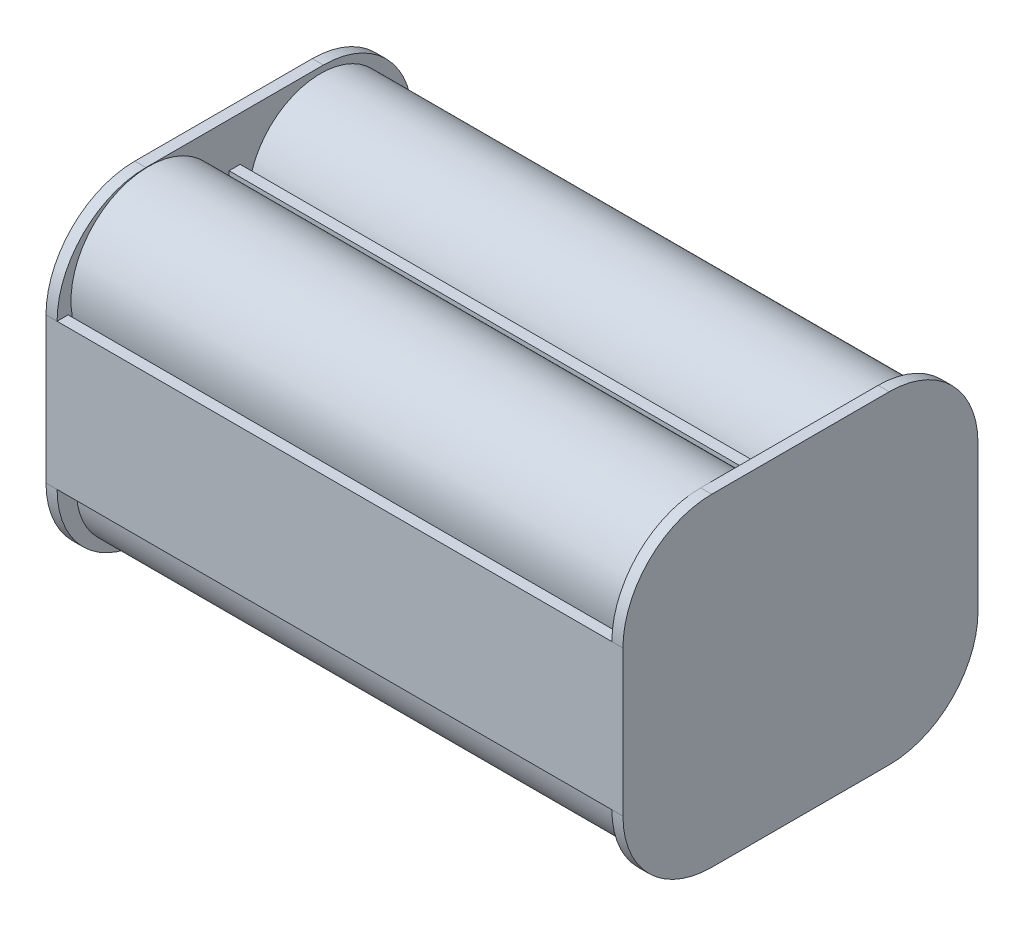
ISO-10303-21;
HEADER;
FILE_DESCRIPTION(('STEP AP214'),'2;1');
FILE_NAME('part.step','',(''),(''),'','','');
FILE_SCHEMA(('AUTOMOTIVE_DESIGN { 1 0 10303 214 1 1 1 1 }'));
ENDSEC;
DATA;
#1=APPLICATION_CONTEXT('core data for automotive mechanical design processes');
#2=APPLICATION_PROTOCOL_DEFINITION('international standard','automotive_design',2000,#1);
#3=PRODUCT_CONTEXT('',#1,'mechanical');
#4=PRODUCT('Part','Part','',(#3));
#5=PRODUCT_RELATED_PRODUCT_CATEGORY('part','',(#4));
#6=PRODUCT_DEFINITION_FORMATION('','',#4);
#7=PRODUCT_DEFINITION_CONTEXT('part definition',#1,'design');
#8=PRODUCT_DEFINITION('design','',#6,#7);
#9=PRODUCT_DEFINITION_SHAPE('','',#8);
#10=(LENGTH_UNIT() NAMED_UNIT(*) SI_UNIT(.MILLI.,.METRE.));
#11=(NAMED_UNIT(*) PLANE_ANGLE_UNIT() SI_UNIT($,.RADIAN.));
#12=(NAMED_UNIT(*) SI_UNIT($,.STERADIAN.) SOLID_ANGLE_UNIT());
#13=UNCERTAINTY_MEASURE_WITH_UNIT(LENGTH_MEASURE(1.E-05),#10,'distance_accuracy_value','');
#14=(GEOMETRIC_REPRESENTATION_CONTEXT(3) GLOBAL_UNCERTAINTY_ASSIGNED_CONTEXT((#13)) GLOBAL_UNIT_ASSIGNED_CONTEXT((#10,
#11,#12)) REPRESENTATION_CONTEXT('',''));
#15=CARTESIAN_POINT('',(0.,0.,0.));
#16=DIRECTION('',(0.,0.,1.));
#17=DIRECTION('',(1.,0.,0.));
#18=AXIS2_PLACEMENT_3D('',#15,#16,#17);
#19=CARTESIAN_POINT('',(1.,10.6966292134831,5.30337078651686));
#20=DIRECTION('',(1.,0.,0.));
#21=DIRECTION('',(0.,0.,-1.));
#22=AXIS2_PLACEMENT_3D('',#19,#20,#21);
#23=PLANE('',#22);
#24=CARTESIAN_POINT('',(1.,-3.39606741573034,5.05337078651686));
#25=DIRECTION('',(1.,0.,0.));
#26=DIRECTION('',(0.,0.,-1.));
#27=AXIS2_PLACEMENT_3D('',#24,#25,#26);
#28=CIRCLE('',#27,6.5);
#29=CARTESIAN_POINT('',(1.,-3.39606741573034,-1.44662921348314));
#30=VERTEX_POINT('',#29);
#31=EDGE_CURVE('E317',#30,#30,#28,.T.);
#32=ORIENTED_EDGE('',*,*,#31,.F.);
#33=EDGE_LOOP('',(#32));
#34=FACE_BOUND('',#33,.T.);
#35=CARTESIAN_POINT('',(1.,-2.42696629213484,-10.6966292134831));
#36=DIRECTION('',(1.,0.,0.));
#37=DIRECTION('',(0.,0.,-1.));
#38=AXIS2_PLACEMENT_3D('',#35,#36,#37);
#39=CIRCLE('',#38,8.);
#40=CARTESIAN_POINT('',(1.,-10.4269662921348,-10.6966292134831));
#41=VERTEX_POINT('',#40);
#42=CARTESIAN_POINT('',(1.,-2.42696629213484,-18.6966292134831));
#43=VERTEX_POINT('',#42);
#44=EDGE_CURVE('E490',#41,#43,#39,.T.);
#45=ORIENTED_EDGE('',*,*,#44,.T.);
#46=DIRECTION('',(0.,0.,1.));
#47=VECTOR('',#46,1.);
#48=CARTESIAN_POINT('',(1.,-2.42696629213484,0.));
#49=LINE('',#48,#47);
#50=CARTESIAN_POINT('',(1.,-2.42696629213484,-17.6966292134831));
#51=VERTEX_POINT('',#50);
#52=EDGE_CURVE('E50',#43,#51,#49,.T.);
#53=ORIENTED_EDGE('',*,*,#52,.T.);
#54=DIRECTION('',(0.,1.,0.));
#55=VECTOR('',#54,1.);
#56=CARTESIAN_POINT('',(1.,0.,-17.6966292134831));
#57=LINE('',#56,#55);
#58=CARTESIAN_POINT('',(1.,3.63483146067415,-17.6966292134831));
#59=VERTEX_POINT('',#58);
#60=EDGE_CURVE('E55',#51,#59,#57,.T.);
#61=ORIENTED_EDGE('',*,*,#60,.T.);
#62=DIRECTION('',(0.,0.,-1.));
#63=VECTOR('',#62,1.);
#64=CARTESIAN_POINT('',(1.,3.63483146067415,0.));
#65=LINE('',#64,#63);
#66=CARTESIAN_POINT('',(1.,3.63483146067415,-3.19662921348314));
#67=VERTEX_POINT('',#66);
#68=EDGE_CURVE('E420',#67,#59,#65,.T.);
#69=ORIENTED_EDGE('',*,*,#68,.F.);
#70=DIRECTION('',(0.,1.,0.));
#71=VECTOR('',#70,1.);
#72=CARTESIAN_POINT('',(1.,0.,-3.19662921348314));
#73=LINE('',#72,#71);
#74=CARTESIAN_POINT('',(1.,-6.42696629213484,-3.19662921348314));
#75=VERTEX_POINT('',#74);
#76=EDGE_CURVE('E417',#75,#67,#73,.T.);
#77=ORIENTED_EDGE('',*,*,#76,.F.);
#78=DIRECTION('',(0.,0.,-1.));
#79=VECTOR('',#78,1.);
#80=CARTESIAN_POINT('',(1.,-6.42696629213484,0.));
#81=LINE('',#80,#79);
#82=CARTESIAN_POINT('',(1.,-6.42696629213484,-2.19662921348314));
#83=VERTEX_POINT('',#82);
#84=EDGE_CURVE('E414',#83,#75,#81,.T.);
#85=ORIENTED_EDGE('',*,*,#84,.F.);
#86=DIRECTION('',(0.,-1.,0.));
#87=VECTOR('',#86,1.);
#88=CARTESIAN_POINT('',(1.,0.,-2.19662921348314));
#89=LINE('',#88,#87);
#90=CARTESIAN_POINT('',(1.,3.63483146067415,-2.19662921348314));
#91=VERTEX_POINT('',#90);
#92=EDGE_CURVE('E411',#91,#83,#89,.T.);
#93=ORIENTED_EDGE('',*,*,#92,.F.);
#94=DIRECTION('',(0.,0.,-1.));
#95=VECTOR('',#94,1.);
#96=CARTESIAN_POINT('',(1.,3.63483146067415,0.));
#97=LINE('',#96,#95);
#98=CARTESIAN_POINT('',(1.,3.63483146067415,12.3033707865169));
#99=VERTEX_POINT('',#98);
#100=EDGE_CURVE('E408',#99,#91,#97,.T.);
#101=ORIENTED_EDGE('',*,*,#100,.F.);
#102=DIRECTION('',(0.,1.,0.));
#103=VECTOR('',#102,1.);
#104=CARTESIAN_POINT('',(1.,0.,12.3033707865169));
#105=LINE('',#104,#103);
#106=CARTESIAN_POINT('',(1.,-2.42696629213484,12.3033707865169));
#107=VERTEX_POINT('',#106);
#108=EDGE_CURVE('E405',#107,#99,#105,.T.);
#109=ORIENTED_EDGE('',*,*,#108,.F.);
#110=DIRECTION('',(0.,0.,-1.));
#111=VECTOR('',#110,1.);
#112=CARTESIAN_POINT('',(1.,-2.42696629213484,0.));
#113=LINE('',#112,#111);
#114=CARTESIAN_POINT('',(1.,-2.42696629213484,13.3033707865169));
#115=VERTEX_POINT('',#114);
#116=EDGE_CURVE('E402',#115,#107,#113,.T.);
#117=ORIENTED_EDGE('',*,*,#116,.F.);
#118=CARTESIAN_POINT('',(1.,-2.42696629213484,5.30337078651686));
#119=DIRECTION('',(1.,0.,0.));
#120=DIRECTION('',(0.,0.,-1.));
#121=AXIS2_PLACEMENT_3D('',#118,#119,#120);
#122=CIRCLE('',#121,8.);
#123=CARTESIAN_POINT('',(1.,-10.4269662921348,5.30337078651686));
#124=VERTEX_POINT('',#123);
#125=EDGE_CURVE('E485',#115,#124,#122,.T.);
#126=ORIENTED_EDGE('',*,*,#125,.T.);
#127=DIRECTION('',(0.,0.,-1.));
#128=VECTOR('',#127,1.);
#129=CARTESIAN_POINT('',(1.,-10.4269662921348,5.30337078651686));
#130=LINE('',#129,#128);
#131=EDGE_CURVE('E488',#124,#41,#130,.T.);
#132=ORIENTED_EDGE('',*,*,#131,.T.);
#133=EDGE_LOOP('',(#45,#53,#61,#69,#77,#85,#93,#101,#109,#117,#126,#132));
#134=FACE_BOUND('',#133,.T.);
#135=CARTESIAN_POINT('',(1.,-3.39606741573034,-10.4466292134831));
#136=DIRECTION('',(1.,0.,0.));
#137=DIRECTION('',(0.,0.,-1.));
#138=AXIS2_PLACEMENT_3D('',#135,#136,#137);
#139=CIRCLE('',#138,6.5);
#140=CARTESIAN_POINT('',(1.,-3.39606741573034,-16.9466292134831));
#141=VERTEX_POINT('',#140);
#142=EDGE_CURVE('E299',#141,#141,#139,.T.);
#143=ORIENTED_EDGE('',*,*,#142,.F.);
#144=EDGE_LOOP('',(#143));
#145=FACE_BOUND('',#144,.T.);
#146=ADVANCED_FACE('F35',(#34,#134,#145),#23,.T.);
#147=CARTESIAN_POINT('',(1.,11.6657303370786,5.05337078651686));
#148=DIRECTION('',(1.,0.,0.));
#149=DIRECTION('',(0.,0.,-1.));
#150=AXIS2_PLACEMENT_3D('',#147,#148,#149);
#151=CIRCLE('',#150,7.);
#152=CARTESIAN_POINT('',(1.,11.6657303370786,-1.94662921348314));
#153=VERTEX_POINT('',#152);
#154=EDGE_CURVE('E329',#153,#153,#151,.T.);
#155=ORIENTED_EDGE('',*,*,#154,.F.);
#156=EDGE_LOOP('',(#155));
#157=FACE_BOUND('',#156,.T.);
#158=DIRECTION('',(0.,1.,0.));
#159=VECTOR('',#158,1.);
#160=CARTESIAN_POINT('',(1.,0.,-17.6966292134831));
#161=LINE('',#160,#159);
#162=CARTESIAN_POINT('',(1.,4.63483146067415,-17.6966292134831));
#163=VERTEX_POINT('',#162);
#164=CARTESIAN_POINT('',(1.,10.6966292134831,-17.6966292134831));
#165=VERTEX_POINT('',#164);
#166=EDGE_CURVE('E335',#163,#165,#161,.T.);
#167=ORIENTED_EDGE('',*,*,#166,.T.);
#168=DIRECTION('',(0.,0.,-1.));
#169=VECTOR('',#168,1.);
#170=CARTESIAN_POINT('',(1.,10.6966292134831,0.));
#171=LINE('',#170,#169);
#172=CARTESIAN_POINT('',(1.,10.6966292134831,-18.6966292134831));
#173=VERTEX_POINT('',#172);
#174=EDGE_CURVE('E342',#165,#173,#171,.T.);
#175=ORIENTED_EDGE('',*,*,#174,.T.);
#176=CARTESIAN_POINT('',(1.,10.6966292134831,-10.6966292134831));
#177=DIRECTION('',(1.,0.,0.));
#178=DIRECTION('',(0.,0.,1.));
#179=AXIS2_PLACEMENT_3D('',#176,#177,#178);
#180=CIRCLE('',#179,8.);
#181=CARTESIAN_POINT('',(1.,18.6966292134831,-10.6966292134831));
#182=VERTEX_POINT('',#181);
#183=EDGE_CURVE('E492',#173,#182,#180,.T.);
#184=ORIENTED_EDGE('',*,*,#183,.T.);
#185=DIRECTION('',(0.,0.,1.));
#186=VECTOR('',#185,1.);
#187=CARTESIAN_POINT('',(1.,18.6966292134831,5.30337078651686));
#188=LINE('',#187,#186);
#189=CARTESIAN_POINT('',(1.,18.6966292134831,5.30337078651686));
#190=VERTEX_POINT('',#189);
#191=EDGE_CURVE('E494',#182,#190,#188,.T.);
#192=ORIENTED_EDGE('',*,*,#191,.T.);
#193=CARTESIAN_POINT('',(1.,10.6966292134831,5.30337078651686));
#194=DIRECTION('',(1.,0.,0.));
#195=DIRECTION('',(0.,0.,-1.));
#196=AXIS2_PLACEMENT_3D('',#193,#194,#195);
#197=CIRCLE('',#196,8.);
#198=CARTESIAN_POINT('',(1.,10.6966292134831,13.3033707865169));
#199=VERTEX_POINT('',#198);
#200=EDGE_CURVE('E483',#190,#199,#197,.T.);
#201=ORIENTED_EDGE('',*,*,#200,.T.);
#202=DIRECTION('',(0.,0.,1.));
#203=VECTOR('',#202,1.);
#204=CARTESIAN_POINT('',(1.,10.6966292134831,0.));
#205=LINE('',#204,#203);
#206=CARTESIAN_POINT('',(1.,10.6966292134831,12.3033707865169));
#207=VERTEX_POINT('',#206);
#208=EDGE_CURVE('E399',#207,#199,#205,.T.);
#209=ORIENTED_EDGE('',*,*,#208,.F.);
#210=DIRECTION('',(0.,1.,0.));
#211=VECTOR('',#210,1.);
#212=CARTESIAN_POINT('',(1.,0.,12.3033707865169));
#213=LINE('',#212,#211);
#214=CARTESIAN_POINT('',(1.,4.63483146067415,12.3033707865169));
#215=VERTEX_POINT('',#214);
#216=EDGE_CURVE('E396',#215,#207,#213,.T.);
#217=ORIENTED_EDGE('',*,*,#216,.F.);
#218=DIRECTION('',(0.,0.,1.));
#219=VECTOR('',#218,1.);
#220=CARTESIAN_POINT('',(1.,4.63483146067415,0.));
#221=LINE('',#220,#219);
#222=CARTESIAN_POINT('',(1.,4.63483146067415,-2.19662921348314));
#223=VERTEX_POINT('',#222);
#224=EDGE_CURVE('E393',#223,#215,#221,.T.);
#225=ORIENTED_EDGE('',*,*,#224,.F.);
#226=DIRECTION('',(0.,-1.,0.));
#227=VECTOR('',#226,1.);
#228=CARTESIAN_POINT('',(1.,0.,-2.19662921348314));
#229=LINE('',#228,#227);
#230=CARTESIAN_POINT('',(1.,14.6966292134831,-2.19662921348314));
#231=VERTEX_POINT('',#230);
#232=EDGE_CURVE('E390',#231,#223,#229,.T.);
#233=ORIENTED_EDGE('',*,*,#232,.F.);
#234=DIRECTION('',(0.,0.,-1.));
#235=VECTOR('',#234,1.);
#236=CARTESIAN_POINT('',(1.,14.6966292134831,0.));
#237=LINE('',#236,#235);
#238=CARTESIAN_POINT('',(1.,14.6966292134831,-3.19662921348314));
#239=VERTEX_POINT('',#238);
#240=EDGE_CURVE('E388',#231,#239,#237,.T.);
#241=ORIENTED_EDGE('',*,*,#240,.T.);
#242=DIRECTION('',(0.,1.,0.));
#243=VECTOR('',#242,1.);
#244=CARTESIAN_POINT('',(1.,0.,-3.19662921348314));
#245=LINE('',#244,#243);
#246=CARTESIAN_POINT('',(1.,4.63483146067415,-3.19662921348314));
#247=VERTEX_POINT('',#246);
#248=EDGE_CURVE('E385',#247,#239,#245,.T.);
#249=ORIENTED_EDGE('',*,*,#248,.F.);
#250=DIRECTION('',(0.,0.,1.));
#251=VECTOR('',#250,1.);
#252=CARTESIAN_POINT('',(1.,4.63483146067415,0.));
#253=LINE('',#252,#251);
#254=EDGE_CURVE('E382',#163,#247,#253,.T.);
#255=ORIENTED_EDGE('',*,*,#254,.F.);
#256=EDGE_LOOP('',(#167,#175,#184,#192,#201,#209,#217,#225,#233,#241,#249,#255));
#257=FACE_BOUND('',#256,.T.);
#258=CARTESIAN_POINT('',(1.,11.6657303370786,-10.4466292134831));
#259=DIRECTION('',(1.,0.,0.));
#260=DIRECTION('',(0.,0.,-1.));
#261=AXIS2_PLACEMENT_3D('',#258,#259,#260);
#262=CIRCLE('',#261,6.5);
#263=CARTESIAN_POINT('',(1.,11.6657303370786,-16.9466292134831));
#264=VERTEX_POINT('',#263);
#265=EDGE_CURVE('E323',#264,#264,#262,.T.);
#266=ORIENTED_EDGE('',*,*,#265,.F.);
#267=EDGE_LOOP('',(#266));
#268=FACE_BOUND('',#267,.T.);
#269=ADVANCED_FACE('F640',(#157,#257,#268),#23,.T.);
#270=CARTESIAN_POINT('',(1.,10.6966292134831,5.30337078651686));
#271=DIRECTION('',(-1.,0.,0.));
#272=DIRECTION('',(0.,0.,1.));
#273=AXIS2_PLACEMENT_3D('',#270,#271,#272);
#274=CYLINDRICAL_SURFACE('',#273,8.);
#275=CARTESIAN_POINT('',(0.,10.6966292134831,5.30337078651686));
#276=DIRECTION('',(1.,0.,0.));
#277=DIRECTION('',(0.,0.,-1.));
#278=AXIS2_PLACEMENT_3D('',#275,#276,#277);
#279=CIRCLE('',#278,8.);
#280=CARTESIAN_POINT('',(0.,18.6966292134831,5.30337078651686));
#281=VERTEX_POINT('',#280);
#282=CARTESIAN_POINT('',(0.,10.6966292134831,13.3033707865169));
#283=VERTEX_POINT('',#282);
#284=EDGE_CURVE('E482',#281,#283,#279,.T.);
#285=ORIENTED_EDGE('',*,*,#284,.T.);
#286=DIRECTION('',(-1.,0.,0.));
#287=VECTOR('',#286,1.);
#288=CARTESIAN_POINT('',(1.,10.6966292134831,13.3033707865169));
#289=LINE('',#288,#287);
#290=EDGE_CURVE('E11',#199,#283,#289,.T.);
#291=ORIENTED_EDGE('',*,*,#290,.F.);
#292=ORIENTED_EDGE('',*,*,#200,.F.);
#293=DIRECTION('',(-1.,0.,0.));
#294=VECTOR('',#293,1.);
#295=CARTESIAN_POINT('',(1.,18.6966292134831,5.30337078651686));
#296=LINE('',#295,#294);
#297=EDGE_CURVE('E496',#190,#281,#296,.T.);
#298=ORIENTED_EDGE('',*,*,#297,.T.);
#299=EDGE_LOOP('',(#285,#291,#292,#298));
#300=FACE_BOUND('',#299,.T.);
#301=ADVANCED_FACE('F37',(#300),#274,.T.);
#302=CARTESIAN_POINT('',(1.,10.6966292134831,13.3033707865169));
#303=DIRECTION('',(0.,0.,-1.));
#304=DIRECTION('',(0.,1.,0.));
#305=AXIS2_PLACEMENT_3D('',#302,#303,#304);
#306=PLANE('',#305);
#307=DIRECTION('',(0.,-1.,0.));
#308=VECTOR('',#307,1.);
#309=CARTESIAN_POINT('',(0.,10.6966292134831,13.3033707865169));
#310=LINE('',#309,#308);
#311=CARTESIAN_POINT('',(0.,-2.42696629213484,13.3033707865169));
#312=VERTEX_POINT('',#311);
#313=EDGE_CURVE('E499',#283,#312,#310,.T.);
#314=ORIENTED_EDGE('',*,*,#313,.T.);
#315=DIRECTION('',(-1.,0.,0.));
#316=VECTOR('',#315,1.);
#317=CARTESIAN_POINT('',(1.,-2.42696629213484,13.3033707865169));
#318=LINE('',#317,#316);
#319=EDGE_CURVE('E43',#115,#312,#318,.T.);
#320=ORIENTED_EDGE('',*,*,#319,.F.);
#321=DIRECTION('',(-1.,0.,0.));
#322=VECTOR('',#321,1.);
#323=CARTESIAN_POINT('',(51.,-2.42696629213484,13.3033707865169));
#324=LINE('',#323,#322);
#325=CARTESIAN_POINT('',(51.,-2.42696629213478,13.3033707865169));
#326=VERTEX_POINT('',#325);
#327=EDGE_CURVE('E456',#326,#115,#324,.T.);
#328=ORIENTED_EDGE('',*,*,#327,.F.);
#329=DIRECTION('',(-1.,0.,0.));
#330=VECTOR('',#329,1.);
#331=CARTESIAN_POINT('',(52.,-2.42696629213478,13.3033707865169));
#332=LINE('',#331,#330);
#333=CARTESIAN_POINT('',(52.,-2.42696629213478,13.3033707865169));
#334=VERTEX_POINT('',#333);
#335=EDGE_CURVE('E270',#334,#326,#332,.T.);
#336=ORIENTED_EDGE('',*,*,#335,.F.);
#337=DIRECTION('',(0.,1.,0.));
#338=VECTOR('',#337,1.);
#339=CARTESIAN_POINT('',(52.,-2.42696629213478,13.3033707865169));
#340=LINE('',#339,#338);
#341=CARTESIAN_POINT('',(52.,10.6966292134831,13.3033707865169));
#342=VERTEX_POINT('',#341);
#343=EDGE_CURVE('E262',#334,#342,#340,.T.);
#344=ORIENTED_EDGE('',*,*,#343,.T.);
#345=DIRECTION('',(-1.,0.,0.));
#346=VECTOR('',#345,1.);
#347=CARTESIAN_POINT('',(52.,10.6966292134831,13.3033707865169));
#348=LINE('',#347,#346);
#349=CARTESIAN_POINT('',(51.,10.6966292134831,13.3033707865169));
#350=VERTEX_POINT('',#349);
#351=EDGE_CURVE('E244',#342,#350,#348,.T.);
#352=ORIENTED_EDGE('',*,*,#351,.T.);
#353=DIRECTION('',(-1.,0.,0.));
#354=VECTOR('',#353,1.);
#355=CARTESIAN_POINT('',(51.,10.6966292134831,13.3033707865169));
#356=LINE('',#355,#354);
#357=EDGE_CURVE('E459',#350,#199,#356,.T.);
#358=ORIENTED_EDGE('',*,*,#357,.T.);
#359=ORIENTED_EDGE('',*,*,#290,.T.);
#360=EDGE_LOOP('',(#314,#320,#328,#336,#344,#352,#358,#359));
#361=FACE_BOUND('',#360,.T.);
#362=ADVANCED_FACE('F268',(#361),#306,.F.);
#363=CARTESIAN_POINT('',(1.,-2.42696629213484,5.30337078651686));
#364=DIRECTION('',(-1.,0.,0.));
#365=DIRECTION('',(0.,0.,1.));
#366=AXIS2_PLACEMENT_3D('',#363,#364,#365);
#367=CYLINDRICAL_SURFACE('',#366,8.);
#368=CARTESIAN_POINT('',(0.,-2.42696629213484,5.30337078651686));
#369=DIRECTION('',(1.,0.,0.));
#370=DIRECTION('',(0.,0.,-1.));
#371=AXIS2_PLACEMENT_3D('',#368,#369,#370);
#372=CIRCLE('',#371,8.);
#373=CARTESIAN_POINT('',(0.,-10.4269662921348,5.30337078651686));
#374=VERTEX_POINT('',#373);
#375=EDGE_CURVE('E501',#312,#374,#372,.T.);
#376=ORIENTED_EDGE('',*,*,#375,.T.);
#377=DIRECTION('',(-1.,0.,0.));
#378=VECTOR('',#377,1.);
#379=CARTESIAN_POINT('',(1.,-10.4269662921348,5.30337078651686));
#380=LINE('',#379,#378);
#381=EDGE_CURVE('E526',#124,#374,#380,.T.);
#382=ORIENTED_EDGE('',*,*,#381,.F.);
#383=ORIENTED_EDGE('',*,*,#125,.F.);
#384=ORIENTED_EDGE('',*,*,#319,.T.);
#385=EDGE_LOOP('',(#376,#382,#383,#384));
#386=FACE_BOUND('',#385,.T.);
#387=ADVANCED_FACE('F533',(#386),#367,.T.);
#388=CARTESIAN_POINT('',(1.,-10.4269662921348,5.30337078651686));
#389=DIRECTION('',(0.,1.,0.));
#390=DIRECTION('',(0.,0.,1.));
#391=AXIS2_PLACEMENT_3D('',#388,#389,#390);
#392=PLANE('',#391);
#393=DIRECTION('',(0.,0.,-1.));
#394=VECTOR('',#393,1.);
#395=CARTESIAN_POINT('',(0.,-10.4269662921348,5.30337078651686));
#396=LINE('',#395,#394);
#397=CARTESIAN_POINT('',(0.,-10.4269662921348,-10.6966292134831));
#398=VERTEX_POINT('',#397);
#399=EDGE_CURVE('E503',#374,#398,#396,.T.);
#400=ORIENTED_EDGE('',*,*,#399,.T.);
#401=DIRECTION('',(-1.,0.,0.));
#402=VECTOR('',#401,1.);
#403=CARTESIAN_POINT('',(1.,-10.4269662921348,-10.6966292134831));
#404=LINE('',#403,#402);
#405=EDGE_CURVE('E523',#41,#398,#404,.T.);
#406=ORIENTED_EDGE('',*,*,#405,.F.);
#407=ORIENTED_EDGE('',*,*,#131,.F.);
#408=ORIENTED_EDGE('',*,*,#381,.T.);
#409=EDGE_LOOP('',(#400,#406,#407,#408));
#410=FACE_BOUND('',#409,.T.);
#411=ADVANCED_FACE('F543',(#410),#392,.F.);
#412=CARTESIAN_POINT('',(1.,-2.42696629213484,-10.6966292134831));
#413=DIRECTION('',(-1.,0.,0.));
#414=DIRECTION('',(0.,0.,1.));
#415=AXIS2_PLACEMENT_3D('',#412,#413,#414);
#416=CYLINDRICAL_SURFACE('',#415,8.);
#417=CARTESIAN_POINT('',(0.,-2.42696629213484,-10.6966292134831));
#418=DIRECTION('',(1.,0.,0.));
#419=DIRECTION('',(0.,0.,-1.));
#420=AXIS2_PLACEMENT_3D('',#417,#418,#419);
#421=CIRCLE('',#420,8.);
#422=CARTESIAN_POINT('',(0.,-2.42696629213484,-18.6966292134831));
#423=VERTEX_POINT('',#422);
#424=EDGE_CURVE('E505',#398,#423,#421,.T.);
#425=ORIENTED_EDGE('',*,*,#424,.T.);
#426=DIRECTION('',(-1.,0.,0.));
#427=VECTOR('',#426,1.);
#428=CARTESIAN_POINT('',(1.,-2.42696629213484,-18.6966292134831));
#429=LINE('',#428,#427);
#430=EDGE_CURVE('E520',#43,#423,#429,.T.);
#431=ORIENTED_EDGE('',*,*,#430,.F.);
#432=ORIENTED_EDGE('',*,*,#44,.F.);
#433=ORIENTED_EDGE('',*,*,#405,.T.);
#434=EDGE_LOOP('',(#425,#431,#432,#433));
#435=FACE_BOUND('',#434,.T.);
#436=ADVANCED_FACE('F547',(#435),#416,.T.);
#437=CARTESIAN_POINT('',(1.,10.6966292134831,-18.6966292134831));
#438=DIRECTION('',(0.,0.,1.));
#439=DIRECTION('',(1.,0.,0.));
#440=AXIS2_PLACEMENT_3D('',#437,#438,#439);
#441=PLANE('',#440);
#442=DIRECTION('',(0.,1.,0.));
#443=VECTOR('',#442,1.);
#444=CARTESIAN_POINT('',(0.,10.6966292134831,-18.6966292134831));
#445=LINE('',#444,#443);
#446=CARTESIAN_POINT('',(0.,10.6966292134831,-18.6966292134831));
#447=VERTEX_POINT('',#446);
#448=EDGE_CURVE('E507',#423,#447,#445,.T.);
#449=ORIENTED_EDGE('',*,*,#448,.T.);
#450=DIRECTION('',(-1.,0.,0.));
#451=VECTOR('',#450,1.);
#452=CARTESIAN_POINT('',(1.,10.6966292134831,-18.6966292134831));
#453=LINE('',#452,#451);
#454=EDGE_CURVE('E517',#173,#447,#453,.T.);
#455=ORIENTED_EDGE('',*,*,#454,.F.);
#456=DIRECTION('',(-1.,0.,0.));
#457=VECTOR('',#456,1.);
#458=CARTESIAN_POINT('',(51.,10.6966292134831,-18.6966292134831));
#459=LINE('',#458,#457);
#460=CARTESIAN_POINT('',(51.,10.6966292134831,-18.6966292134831));
#461=VERTEX_POINT('',#460);
#462=EDGE_CURVE('E428',#461,#173,#459,.T.);
#463=ORIENTED_EDGE('',*,*,#462,.F.);
#464=DIRECTION('',(-1.,0.,0.));
#465=VECTOR('',#464,1.);
#466=CARTESIAN_POINT('',(52.,10.6966292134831,-18.6966292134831));
#467=LINE('',#466,#465);
#468=CARTESIAN_POINT('',(52.,10.6966292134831,-18.6966292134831));
#469=VERTEX_POINT('',#468);
#470=EDGE_CURVE('E308',#469,#461,#467,.T.);
#471=ORIENTED_EDGE('',*,*,#470,.F.);
#472=DIRECTION('',(0.,1.,0.));
#473=VECTOR('',#472,1.);
#474=CARTESIAN_POINT('',(52.,-2.42696629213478,-18.6966292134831));
#475=LINE('',#474,#473);
#476=CARTESIAN_POINT('',(52.,-2.42696629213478,-18.6966292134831));
#477=VERTEX_POINT('',#476);
#478=EDGE_CURVE('E281',#477,#469,#475,.T.);
#479=ORIENTED_EDGE('',*,*,#478,.F.);
#480=DIRECTION('',(-1.,0.,0.));
#481=VECTOR('',#480,1.);
#482=CARTESIAN_POINT('',(52.,-2.42696629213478,-18.6966292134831));
#483=LINE('',#482,#481);
#484=CARTESIAN_POINT('',(51.,-2.42696629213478,-18.6966292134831));
#485=VERTEX_POINT('',#484);
#486=EDGE_CURVE('E305',#477,#485,#483,.T.);
#487=ORIENTED_EDGE('',*,*,#486,.T.);
#488=DIRECTION('',(-1.,0.,0.));
#489=VECTOR('',#488,1.);
#490=CARTESIAN_POINT('',(51.,-2.42696629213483,-18.6966292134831));
#491=LINE('',#490,#489);
#492=EDGE_CURVE('E431',#485,#43,#491,.T.);
#493=ORIENTED_EDGE('',*,*,#492,.T.);
#494=ORIENTED_EDGE('',*,*,#430,.T.);
#495=EDGE_LOOP('',(#449,#455,#463,#471,#479,#487,#493,#494));
#496=FACE_BOUND('',#495,.T.);
#497=ADVANCED_FACE('F579',(#496),#441,.F.);
#498=CARTESIAN_POINT('',(1.,10.6966292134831,-10.6966292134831));
#499=DIRECTION('',(-1.,0.,0.));
#500=DIRECTION('',(0.,0.,1.));
#501=AXIS2_PLACEMENT_3D('',#498,#499,#500);
#502=CYLINDRICAL_SURFACE('',#501,8.);
#503=CARTESIAN_POINT('',(0.,10.6966292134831,-10.6966292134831));
#504=DIRECTION('',(1.,0.,0.));
#505=DIRECTION('',(0.,0.,1.));
#506=AXIS2_PLACEMENT_3D('',#503,#504,#505);
#507=CIRCLE('',#506,8.);
#508=CARTESIAN_POINT('',(0.,18.6966292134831,-10.6966292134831));
#509=VERTEX_POINT('',#508);
#510=EDGE_CURVE('E509',#447,#509,#507,.T.);
#511=ORIENTED_EDGE('',*,*,#510,.T.);
#512=DIRECTION('',(-1.,0.,0.));
#513=VECTOR('',#512,1.);
#514=CARTESIAN_POINT('',(1.,18.6966292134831,-10.6966292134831));
#515=LINE('',#514,#513);
#516=EDGE_CURVE('E514',#182,#509,#515,.T.);
#517=ORIENTED_EDGE('',*,*,#516,.F.);
#518=ORIENTED_EDGE('',*,*,#183,.F.);
#519=ORIENTED_EDGE('',*,*,#454,.T.);
#520=EDGE_LOOP('',(#511,#517,#518,#519));
#521=FACE_BOUND('',#520,.T.);
#522=ADVANCED_FACE('F606',(#521),#502,.T.);
#523=CARTESIAN_POINT('',(1.,18.6966292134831,5.30337078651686));
#524=DIRECTION('',(0.,-1.,0.));
#525=DIRECTION('',(0.,0.,-1.));
#526=AXIS2_PLACEMENT_3D('',#523,#524,#525);
#527=PLANE('',#526);
#528=DIRECTION('',(0.,0.,1.));
#529=VECTOR('',#528,1.);
#530=CARTESIAN_POINT('',(0.,18.6966292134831,5.30337078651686));
#531=LINE('',#530,#529);
#532=EDGE_CURVE('E486',#509,#281,#531,.T.);
#533=ORIENTED_EDGE('',*,*,#532,.T.);
#534=ORIENTED_EDGE('',*,*,#297,.F.);
#535=ORIENTED_EDGE('',*,*,#191,.F.);
#536=ORIENTED_EDGE('',*,*,#516,.T.);
#537=EDGE_LOOP('',(#533,#534,#535,#536));
#538=FACE_BOUND('',#537,.T.);
#539=ADVANCED_FACE('F601',(#538),#527,.F.);
#540=CARTESIAN_POINT('',(0.,10.6966292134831,5.30337078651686));
#541=DIRECTION('',(1.,0.,0.));
#542=DIRECTION('',(0.,0.,-1.));
#543=AXIS2_PLACEMENT_3D('',#540,#541,#542);
#544=PLANE('',#543);
#545=ORIENTED_EDGE('',*,*,#284,.F.);
#546=ORIENTED_EDGE('',*,*,#532,.F.);
#547=ORIENTED_EDGE('',*,*,#510,.F.);
#548=ORIENTED_EDGE('',*,*,#448,.F.);
#549=ORIENTED_EDGE('',*,*,#424,.F.);
#550=ORIENTED_EDGE('',*,*,#399,.F.);
#551=ORIENTED_EDGE('',*,*,#375,.F.);
#552=ORIENTED_EDGE('',*,*,#313,.F.);
#553=EDGE_LOOP('',(#545,#546,#547,#548,#549,#550,#551,#552));
#554=FACE_BOUND('',#553,.T.);
#555=ADVANCED_FACE('F538',(#554),#544,.F.);
#556=CARTESIAN_POINT('',(51.,0.,-17.6966292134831));
#557=DIRECTION('',(0.,0.,1.));
#558=DIRECTION('',(1.,0.,0.));
#559=AXIS2_PLACEMENT_3D('',#556,#557,#558);
#560=PLANE('',#559);
#561=ORIENTED_EDGE('',*,*,#166,.F.);
#562=DIRECTION('',(-1.,0.,0.));
#563=VECTOR('',#562,1.);
#564=CARTESIAN_POINT('',(51.,4.63483146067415,-17.6966292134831));
#565=LINE('',#564,#563);
#566=CARTESIAN_POINT('',(51.,4.63483146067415,-17.6966292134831));
#567=VERTEX_POINT('',#566);
#568=EDGE_CURVE('E479',#567,#163,#565,.T.);
#569=ORIENTED_EDGE('',*,*,#568,.F.);
#570=DIRECTION('',(0.,1.,0.));
#571=VECTOR('',#570,1.);
#572=CARTESIAN_POINT('',(51.,0.,-17.6966292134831));
#573=LINE('',#572,#571);
#574=CARTESIAN_POINT('',(51.,10.6966292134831,-17.6966292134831));
#575=VERTEX_POINT('',#574);
#576=EDGE_CURVE('E338',#567,#575,#573,.T.);
#577=ORIENTED_EDGE('',*,*,#576,.T.);
#578=DIRECTION('',(-1.,0.,0.));
#579=VECTOR('',#578,1.);
#580=CARTESIAN_POINT('',(51.,10.6966292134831,-17.6966292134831));
#581=LINE('',#580,#579);
#582=EDGE_CURVE('E380',#575,#165,#581,.T.);
#583=ORIENTED_EDGE('',*,*,#582,.T.);
#584=EDGE_LOOP('',(#561,#569,#577,#583));
#585=FACE_BOUND('',#584,.T.);
#586=ADVANCED_FACE('F650',(#585),#560,.T.);
#587=CARTESIAN_POINT('',(51.,4.63483146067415,0.));
#588=DIRECTION('',(0.,-1.,0.));
#589=DIRECTION('',(0.,0.,-1.));
#590=AXIS2_PLACEMENT_3D('',#587,#588,#589);
#591=PLANE('',#590);
#592=ORIENTED_EDGE('',*,*,#254,.T.);
#593=DIRECTION('',(-1.,0.,0.));
#594=VECTOR('',#593,1.);
#595=CARTESIAN_POINT('',(51.,4.63483146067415,-3.19662921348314));
#596=LINE('',#595,#594);
#597=CARTESIAN_POINT('',(51.,4.63483146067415,-3.19662921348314));
#598=VERTEX_POINT('',#597);
#599=EDGE_CURVE('E476',#598,#247,#596,.T.);
#600=ORIENTED_EDGE('',*,*,#599,.F.);
#601=DIRECTION('',(0.,0.,1.));
#602=VECTOR('',#601,1.);
#603=CARTESIAN_POINT('',(51.,4.63483146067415,0.));
#604=LINE('',#603,#602);
#605=EDGE_CURVE('E341',#567,#598,#604,.T.);
#606=ORIENTED_EDGE('',*,*,#605,.F.);
#607=ORIENTED_EDGE('',*,*,#568,.T.);
#608=EDGE_LOOP('',(#592,#600,#606,#607));
#609=FACE_BOUND('',#608,.T.);
#610=ADVANCED_FACE('F742',(#609),#591,.F.);
#611=CARTESIAN_POINT('',(51.,0.,-3.19662921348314));
#612=DIRECTION('',(0.,0.,1.));
#613=DIRECTION('',(1.,0.,0.));
#614=AXIS2_PLACEMENT_3D('',#611,#612,#613);
#615=PLANE('',#614);
#616=ORIENTED_EDGE('',*,*,#248,.T.);
#617=DIRECTION('',(-1.,0.,0.));
#618=VECTOR('',#617,1.);
#619=CARTESIAN_POINT('',(51.,14.6966292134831,-3.19662921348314));
#620=LINE('',#619,#618);
#621=CARTESIAN_POINT('',(51.,14.6966292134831,-3.19662921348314));
#622=VERTEX_POINT('',#621);
#623=EDGE_CURVE('E473',#622,#239,#620,.T.);
#624=ORIENTED_EDGE('',*,*,#623,.F.);
#625=DIRECTION('',(0.,1.,0.));
#626=VECTOR('',#625,1.);
#627=CARTESIAN_POINT('',(51.,0.,-3.19662921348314));
#628=LINE('',#627,#626);
#629=EDGE_CURVE('E344',#598,#622,#628,.T.);
#630=ORIENTED_EDGE('',*,*,#629,.F.);
#631=ORIENTED_EDGE('',*,*,#599,.T.);
#632=EDGE_LOOP('',(#616,#624,#630,#631));
#633=FACE_BOUND('',#632,.T.);
#634=ADVANCED_FACE('F751',(#633),#615,.F.);
#635=CARTESIAN_POINT('',(51.,14.6966292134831,0.));
#636=DIRECTION('',(0.,1.,0.));
#637=DIRECTION('',(0.,0.,1.));
#638=AXIS2_PLACEMENT_3D('',#635,#636,#637);
#639=PLANE('',#638);
#640=ORIENTED_EDGE('',*,*,#240,.F.);
#641=DIRECTION('',(-1.,0.,0.));
#642=VECTOR('',#641,1.);
#643=CARTESIAN_POINT('',(51.,14.6966292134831,-2.19662921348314));
#644=LINE('',#643,#642);
#645=CARTESIAN_POINT('',(51.,14.6966292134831,-2.19662921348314));
#646=VERTEX_POINT('',#645);
#647=EDGE_CURVE('E470',#646,#231,#644,.T.);
#648=ORIENTED_EDGE('',*,*,#647,.F.);
#649=DIRECTION('',(0.,0.,-1.));
#650=VECTOR('',#649,1.);
#651=CARTESIAN_POINT('',(51.,14.6966292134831,0.));
#652=LINE('',#651,#650);
#653=EDGE_CURVE('E346',#646,#622,#652,.T.);
#654=ORIENTED_EDGE('',*,*,#653,.T.);
#655=ORIENTED_EDGE('',*,*,#623,.T.);
#656=EDGE_LOOP('',(#640,#648,#654,#655));
#657=FACE_BOUND('',#656,.T.);
#658=ADVANCED_FACE('F760',(#657),#639,.T.);
#659=CARTESIAN_POINT('',(51.,0.,-2.19662921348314));
#660=DIRECTION('',(0.,0.,-1.));
#661=DIRECTION('',(-1.,0.,0.));
#662=AXIS2_PLACEMENT_3D('',#659,#660,#661);
#663=PLANE('',#662);
#664=ORIENTED_EDGE('',*,*,#232,.T.);
#665=DIRECTION('',(-1.,0.,0.));
#666=VECTOR('',#665,1.);
#667=CARTESIAN_POINT('',(51.,4.63483146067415,-2.19662921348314));
#668=LINE('',#667,#666);
#669=CARTESIAN_POINT('',(51.,4.63483146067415,-2.19662921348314));
#670=VERTEX_POINT('',#669);
#671=EDGE_CURVE('E467',#670,#223,#668,.T.);
#672=ORIENTED_EDGE('',*,*,#671,.F.);
#673=DIRECTION('',(0.,-1.,0.));
#674=VECTOR('',#673,1.);
#675=CARTESIAN_POINT('',(51.,0.,-2.19662921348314));
#676=LINE('',#675,#674);
#677=EDGE_CURVE('E349',#646,#670,#676,.T.);
#678=ORIENTED_EDGE('',*,*,#677,.F.);
#679=ORIENTED_EDGE('',*,*,#647,.T.);
#680=EDGE_LOOP('',(#664,#672,#678,#679));
#681=FACE_BOUND('',#680,.T.);
#682=ADVANCED_FACE('F771',(#681),#663,.F.);
#683=CARTESIAN_POINT('',(51.,4.63483146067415,0.));
#684=DIRECTION('',(0.,-1.,0.));
#685=DIRECTION('',(0.,0.,-1.));
#686=AXIS2_PLACEMENT_3D('',#683,#684,#685);
#687=PLANE('',#686);
#688=ORIENTED_EDGE('',*,*,#224,.T.);
#689=DIRECTION('',(-1.,0.,0.));
#690=VECTOR('',#689,1.);
#691=CARTESIAN_POINT('',(51.,4.63483146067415,12.3033707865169));
#692=LINE('',#691,#690);
#693=CARTESIAN_POINT('',(51.,4.63483146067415,12.3033707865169));
#694=VERTEX_POINT('',#693);
#695=EDGE_CURVE('E464',#694,#215,#692,.T.);
#696=ORIENTED_EDGE('',*,*,#695,.F.);
#697=DIRECTION('',(0.,0.,1.));
#698=VECTOR('',#697,1.);
#699=CARTESIAN_POINT('',(51.,4.63483146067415,0.));
#700=LINE('',#699,#698);
#701=EDGE_CURVE('E351',#670,#694,#700,.T.);
#702=ORIENTED_EDGE('',*,*,#701,.F.);
#703=ORIENTED_EDGE('',*,*,#671,.T.);
#704=EDGE_LOOP('',(#688,#696,#702,#703));
#705=FACE_BOUND('',#704,.T.);
#706=ADVANCED_FACE('F781',(#705),#687,.F.);
#707=CARTESIAN_POINT('',(51.,0.,12.3033707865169));
#708=DIRECTION('',(0.,0.,1.));
#709=DIRECTION('',(1.,0.,0.));
#710=AXIS2_PLACEMENT_3D('',#707,#708,#709);
#711=PLANE('',#710);
#712=ORIENTED_EDGE('',*,*,#216,.T.);
#713=DIRECTION('',(-1.,0.,0.));
#714=VECTOR('',#713,1.);
#715=CARTESIAN_POINT('',(51.,10.6966292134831,12.3033707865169));
#716=LINE('',#715,#714);
#717=CARTESIAN_POINT('',(51.,10.6966292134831,12.3033707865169));
#718=VERTEX_POINT('',#717);
#719=EDGE_CURVE('E461',#718,#207,#716,.T.);
#720=ORIENTED_EDGE('',*,*,#719,.F.);
#721=DIRECTION('',(0.,1.,0.));
#722=VECTOR('',#721,1.);
#723=CARTESIAN_POINT('',(51.,0.,12.3033707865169));
#724=LINE('',#723,#722);
#725=EDGE_CURVE('E353',#694,#718,#724,.T.);
#726=ORIENTED_EDGE('',*,*,#725,.F.);
#727=ORIENTED_EDGE('',*,*,#695,.T.);
#728=EDGE_LOOP('',(#712,#720,#726,#727));
#729=FACE_BOUND('',#728,.T.);
#730=ADVANCED_FACE('F791',(#729),#711,.F.);
#731=CARTESIAN_POINT('',(51.,10.6966292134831,0.));
#732=DIRECTION('',(0.,-1.,0.));
#733=DIRECTION('',(0.,0.,-1.));
#734=AXIS2_PLACEMENT_3D('',#731,#732,#733);
#735=PLANE('',#734);
#736=ORIENTED_EDGE('',*,*,#208,.T.);
#737=ORIENTED_EDGE('',*,*,#357,.F.);
#738=DIRECTION('',(0.,0.,1.));
#739=VECTOR('',#738,1.);
#740=CARTESIAN_POINT('',(51.,10.6966292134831,0.));
#741=LINE('',#740,#739);
#742=EDGE_CURVE('E355',#718,#350,#741,.T.);
#743=ORIENTED_EDGE('',*,*,#742,.F.);
#744=ORIENTED_EDGE('',*,*,#719,.T.);
#745=EDGE_LOOP('',(#736,#737,#743,#744));
#746=FACE_BOUND('',#745,.T.);
#747=ADVANCED_FACE('F593',(#746),#735,.F.);
#748=CARTESIAN_POINT('',(51.,-2.42696629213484,0.));
#749=DIRECTION('',(0.,1.,0.));
#750=DIRECTION('',(0.,0.,1.));
#751=AXIS2_PLACEMENT_3D('',#748,#749,#750);
#752=PLANE('',#751);
#753=ORIENTED_EDGE('',*,*,#116,.T.);
#754=DIRECTION('',(-1.,0.,0.));
#755=VECTOR('',#754,1.);
#756=CARTESIAN_POINT('',(51.,-2.42696629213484,12.3033707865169));
#757=LINE('',#756,#755);
#758=CARTESIAN_POINT('',(51.,-2.42696629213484,12.3033707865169));
#759=VERTEX_POINT('',#758);
#760=EDGE_CURVE('E453',#759,#107,#757,.T.);
#761=ORIENTED_EDGE('',*,*,#760,.F.);
#762=DIRECTION('',(0.,0.,-1.));
#763=VECTOR('',#762,1.);
#764=CARTESIAN_POINT('',(51.,-2.42696629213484,0.));
#765=LINE('',#764,#763);
#766=EDGE_CURVE('E357',#326,#759,#765,.T.);
#767=ORIENTED_EDGE('',*,*,#766,.F.);
#768=ORIENTED_EDGE('',*,*,#327,.T.);
#769=EDGE_LOOP('',(#753,#761,#767,#768));
#770=FACE_BOUND('',#769,.T.);
#771=ADVANCED_FACE('F552',(#770),#752,.F.);
#772=CARTESIAN_POINT('',(51.,0.,12.3033707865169));
#773=DIRECTION('',(0.,0.,1.));
#774=DIRECTION('',(1.,0.,0.));
#775=AXIS2_PLACEMENT_3D('',#772,#773,#774);
#776=PLANE('',#775);
#777=ORIENTED_EDGE('',*,*,#108,.T.);
#778=DIRECTION('',(-1.,0.,0.));
#779=VECTOR('',#778,1.);
#780=CARTESIAN_POINT('',(51.,3.63483146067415,12.3033707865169));
#781=LINE('',#780,#779);
#782=CARTESIAN_POINT('',(51.,3.63483146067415,12.3033707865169));
#783=VERTEX_POINT('',#782);
#784=EDGE_CURVE('E450',#783,#99,#781,.T.);
#785=ORIENTED_EDGE('',*,*,#784,.F.);
#786=DIRECTION('',(0.,1.,0.));
#787=VECTOR('',#786,1.);
#788=CARTESIAN_POINT('',(51.,0.,12.3033707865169));
#789=LINE('',#788,#787);
#790=EDGE_CURVE('E359',#759,#783,#789,.T.);
#791=ORIENTED_EDGE('',*,*,#790,.F.);
#792=ORIENTED_EDGE('',*,*,#760,.T.);
#793=EDGE_LOOP('',(#777,#785,#791,#792));
#794=FACE_BOUND('',#793,.T.);
#795=ADVANCED_FACE('F556',(#794),#776,.F.);
#796=CARTESIAN_POINT('',(51.,3.63483146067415,0.));
#797=DIRECTION('',(0.,1.,0.));
#798=DIRECTION('',(0.,0.,1.));
#799=AXIS2_PLACEMENT_3D('',#796,#797,#798);
#800=PLANE('',#799);
#801=ORIENTED_EDGE('',*,*,#100,.T.);
#802=DIRECTION('',(-1.,0.,0.));
#803=VECTOR('',#802,1.);
#804=CARTESIAN_POINT('',(51.,3.63483146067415,-2.19662921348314));
#805=LINE('',#804,#803);
#806=CARTESIAN_POINT('',(51.,3.63483146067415,-2.19662921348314));
#807=VERTEX_POINT('',#806);
#808=EDGE_CURVE('E447',#807,#91,#805,.T.);
#809=ORIENTED_EDGE('',*,*,#808,.F.);
#810=DIRECTION('',(0.,0.,-1.));
#811=VECTOR('',#810,1.);
#812=CARTESIAN_POINT('',(51.,3.63483146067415,0.));
#813=LINE('',#812,#811);
#814=EDGE_CURVE('E361',#783,#807,#813,.T.);
#815=ORIENTED_EDGE('',*,*,#814,.F.);
#816=ORIENTED_EDGE('',*,*,#784,.T.);
#817=EDGE_LOOP('',(#801,#809,#815,#816));
#818=FACE_BOUND('',#817,.T.);
#819=ADVANCED_FACE('F630',(#818),#800,.F.);
#820=CARTESIAN_POINT('',(51.,0.,-2.19662921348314));
#821=DIRECTION('',(0.,0.,-1.));
#822=DIRECTION('',(0.,1.,0.));
#823=AXIS2_PLACEMENT_3D('',#820,#821,#822);
#824=PLANE('',#823);
#825=ORIENTED_EDGE('',*,*,#92,.T.);
#826=DIRECTION('',(-1.,0.,0.));
#827=VECTOR('',#826,1.);
#828=CARTESIAN_POINT('',(51.,-6.42696629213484,-2.19662921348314));
#829=LINE('',#828,#827);
#830=CARTESIAN_POINT('',(51.,-6.42696629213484,-2.19662921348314));
#831=VERTEX_POINT('',#830);
#832=EDGE_CURVE('E444',#831,#83,#829,.T.);
#833=ORIENTED_EDGE('',*,*,#832,.F.);
#834=DIRECTION('',(0.,-1.,0.));
#835=VECTOR('',#834,1.);
#836=CARTESIAN_POINT('',(51.,0.,-2.19662921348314));
#837=LINE('',#836,#835);
#838=EDGE_CURVE('E363',#807,#831,#837,.T.);
#839=ORIENTED_EDGE('',*,*,#838,.F.);
#840=ORIENTED_EDGE('',*,*,#808,.T.);
#841=EDGE_LOOP('',(#825,#833,#839,#840));
#842=FACE_BOUND('',#841,.T.);
#843=ADVANCED_FACE('F627',(#842),#824,.F.);
#844=CARTESIAN_POINT('',(51.,-6.42696629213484,0.));
#845=DIRECTION('',(0.,1.,0.));
#846=DIRECTION('',(0.,0.,1.));
#847=AXIS2_PLACEMENT_3D('',#844,#845,#846);
#848=PLANE('',#847);
#849=ORIENTED_EDGE('',*,*,#84,.T.);
#850=DIRECTION('',(-1.,0.,0.));
#851=VECTOR('',#850,1.);
#852=CARTESIAN_POINT('',(51.,-6.42696629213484,-3.19662921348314));
#853=LINE('',#852,#851);
#854=CARTESIAN_POINT('',(51.,-6.42696629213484,-3.19662921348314));
#855=VERTEX_POINT('',#854);
#856=EDGE_CURVE('E441',#855,#75,#853,.T.);
#857=ORIENTED_EDGE('',*,*,#856,.F.);
#858=DIRECTION('',(0.,0.,-1.));
#859=VECTOR('',#858,1.);
#860=CARTESIAN_POINT('',(51.,-6.42696629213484,0.));
#861=LINE('',#860,#859);
#862=EDGE_CURVE('E365',#831,#855,#861,.T.);
#863=ORIENTED_EDGE('',*,*,#862,.F.);
#864=ORIENTED_EDGE('',*,*,#832,.T.);
#865=EDGE_LOOP('',(#849,#857,#863,#864));
#866=FACE_BOUND('',#865,.T.);
#867=ADVANCED_FACE('F624',(#866),#848,.F.);
#868=CARTESIAN_POINT('',(51.,0.,-3.19662921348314));
#869=DIRECTION('',(0.,0.,1.));
#870=DIRECTION('',(0.,-1.,0.));
#871=AXIS2_PLACEMENT_3D('',#868,#869,#870);
#872=PLANE('',#871);
#873=ORIENTED_EDGE('',*,*,#76,.T.);
#874=DIRECTION('',(-1.,0.,0.));
#875=VECTOR('',#874,1.);
#876=CARTESIAN_POINT('',(51.,3.63483146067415,-3.19662921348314));
#877=LINE('',#876,#875);
#878=CARTESIAN_POINT('',(51.,3.63483146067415,-3.19662921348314));
#879=VERTEX_POINT('',#878);
#880=EDGE_CURVE('E438',#879,#67,#877,.T.);
#881=ORIENTED_EDGE('',*,*,#880,.F.);
#882=DIRECTION('',(0.,1.,0.));
#883=VECTOR('',#882,1.);
#884=CARTESIAN_POINT('',(51.,0.,-3.19662921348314));
#885=LINE('',#884,#883);
#886=EDGE_CURVE('E367',#855,#879,#885,.T.);
#887=ORIENTED_EDGE('',*,*,#886,.F.);
#888=ORIENTED_EDGE('',*,*,#856,.T.);
#889=EDGE_LOOP('',(#873,#881,#887,#888));
#890=FACE_BOUND('',#889,.T.);
#891=ADVANCED_FACE('F619',(#890),#872,.F.);
#892=CARTESIAN_POINT('',(51.,3.63483146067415,0.));
#893=DIRECTION('',(0.,1.,0.));
#894=DIRECTION('',(0.,0.,1.));
#895=AXIS2_PLACEMENT_3D('',#892,#893,#894);
#896=PLANE('',#895);
#897=ORIENTED_EDGE('',*,*,#68,.T.);
#898=DIRECTION('',(-1.,0.,0.));
#899=VECTOR('',#898,1.);
#900=CARTESIAN_POINT('',(51.,3.63483146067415,-17.6966292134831));
#901=LINE('',#900,#899);
#902=CARTESIAN_POINT('',(51.,3.63483146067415,-17.6966292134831));
#903=VERTEX_POINT('',#902);
#904=EDGE_CURVE('E436',#903,#59,#901,.T.);
#905=ORIENTED_EDGE('',*,*,#904,.F.);
#906=DIRECTION('',(0.,0.,-1.));
#907=VECTOR('',#906,1.);
#908=CARTESIAN_POINT('',(51.,3.63483146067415,0.));
#909=LINE('',#908,#907);
#910=EDGE_CURVE('E369',#879,#903,#909,.T.);
#911=ORIENTED_EDGE('',*,*,#910,.F.);
#912=ORIENTED_EDGE('',*,*,#880,.T.);
#913=EDGE_LOOP('',(#897,#905,#911,#912));
#914=FACE_BOUND('',#913,.T.);
#915=ADVANCED_FACE('F616',(#914),#896,.F.);
#916=CARTESIAN_POINT('',(51.,0.,-17.6966292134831));
#917=DIRECTION('',(0.,0.,1.));
#918=DIRECTION('',(1.,0.,0.));
#919=AXIS2_PLACEMENT_3D('',#916,#917,#918);
#920=PLANE('',#919);
#921=ORIENTED_EDGE('',*,*,#60,.F.);
#922=DIRECTION('',(-1.,0.,0.));
#923=VECTOR('',#922,1.);
#924=CARTESIAN_POINT('',(51.,-2.42696629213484,-17.6966292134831));
#925=LINE('',#924,#923);
#926=CARTESIAN_POINT('',(51.,-2.42696629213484,-17.6966292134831));
#927=VERTEX_POINT('',#926);
#928=EDGE_CURVE('E434',#927,#51,#925,.T.);
#929=ORIENTED_EDGE('',*,*,#928,.F.);
#930=DIRECTION('',(0.,1.,0.));
#931=VECTOR('',#930,1.);
#932=CARTESIAN_POINT('',(51.,0.,-17.6966292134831));
#933=LINE('',#932,#931);
#934=EDGE_CURVE('E371',#927,#903,#933,.T.);
#935=ORIENTED_EDGE('',*,*,#934,.T.);
#936=ORIENTED_EDGE('',*,*,#904,.T.);
#937=EDGE_LOOP('',(#921,#929,#935,#936));
#938=FACE_BOUND('',#937,.T.);
#939=ADVANCED_FACE('F612',(#938),#920,.T.);
#940=CARTESIAN_POINT('',(51.,-2.42696629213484,0.));
#941=DIRECTION('',(0.,-1.,0.));
#942=DIRECTION('',(0.,0.,-1.));
#943=AXIS2_PLACEMENT_3D('',#940,#941,#942);
#944=PLANE('',#943);
#945=ORIENTED_EDGE('',*,*,#52,.F.);
#946=ORIENTED_EDGE('',*,*,#492,.F.);
#947=DIRECTION('',(0.,0.,1.));
#948=VECTOR('',#947,1.);
#949=CARTESIAN_POINT('',(51.,-2.42696629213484,0.));
#950=LINE('',#949,#948);
#951=EDGE_CURVE('E374',#485,#927,#950,.T.);
#952=ORIENTED_EDGE('',*,*,#951,.T.);
#953=ORIENTED_EDGE('',*,*,#928,.T.);
#954=EDGE_LOOP('',(#945,#946,#952,#953));
#955=FACE_BOUND('',#954,.T.);
#956=ADVANCED_FACE('F609',(#955),#944,.T.);
#957=CARTESIAN_POINT('',(51.,10.6966292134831,0.));
#958=DIRECTION('',(0.,1.,0.));
#959=DIRECTION('',(0.,0.,1.));
#960=AXIS2_PLACEMENT_3D('',#957,#958,#959);
#961=PLANE('',#960);
#962=ORIENTED_EDGE('',*,*,#174,.F.);
#963=ORIENTED_EDGE('',*,*,#582,.F.);
#964=DIRECTION('',(0.,0.,-1.));
#965=VECTOR('',#964,1.);
#966=CARTESIAN_POINT('',(51.,10.6966292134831,0.));
#967=LINE('',#966,#965);
#968=EDGE_CURVE('E377',#575,#461,#967,.T.);
#969=ORIENTED_EDGE('',*,*,#968,.T.);
#970=ORIENTED_EDGE('',*,*,#462,.T.);
#971=EDGE_LOOP('',(#962,#963,#969,#970));
#972=FACE_BOUND('',#971,.T.);
#973=ADVANCED_FACE('F874',(#972),#961,.T.);
#974=CARTESIAN_POINT('',(51.,11.6657303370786,5.05337078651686));
#975=DIRECTION('',(-1.,0.,0.));
#976=DIRECTION('',(0.,0.,1.));
#977=AXIS2_PLACEMENT_3D('',#974,#975,#976);
#978=CYLINDRICAL_SURFACE('',#977,7.);
#979=CARTESIAN_POINT('',(51.,11.6657303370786,5.05337078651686));
#980=DIRECTION('',(1.,0.,0.));
#981=DIRECTION('',(0.,0.,-1.));
#982=AXIS2_PLACEMENT_3D('',#979,#980,#981);
#983=CIRCLE('',#982,7.);
#984=CARTESIAN_POINT('',(51.,11.6657303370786,-1.94662921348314));
#985=VERTEX_POINT('',#984);
#986=EDGE_CURVE('E332',#985,#985,#983,.T.);
#987=ORIENTED_EDGE('',*,*,#986,.F.);
#988=EDGE_LOOP('',(#987));
#989=FACE_BOUND('',#988,.T.);
#990=ORIENTED_EDGE('',*,*,#154,.T.);
#991=EDGE_LOOP('',(#990));
#992=FACE_BOUND('',#991,.T.);
#993=ADVANCED_FACE('F685',(#989,#992),#978,.T.);
#994=CARTESIAN_POINT('',(51.,11.6657303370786,-10.4466292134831));
#995=DIRECTION('',(-1.,0.,0.));
#996=DIRECTION('',(0.,0.,1.));
#997=AXIS2_PLACEMENT_3D('',#994,#995,#996);
#998=CYLINDRICAL_SURFACE('',#997,6.5);
#999=CARTESIAN_POINT('',(51.,11.6657303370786,-10.4466292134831));
#1000=DIRECTION('',(1.,0.,0.));
#1001=DIRECTION('',(0.,0.,-1.));
#1002=AXIS2_PLACEMENT_3D('',#999,#1000,#1001);
#1003=CIRCLE('',#1002,6.5);
#1004=CARTESIAN_POINT('',(51.,11.6657303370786,-16.9466292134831));
#1005=VERTEX_POINT('',#1004);
#1006=EDGE_CURVE('E326',#1005,#1005,#1003,.T.);
#1007=ORIENTED_EDGE('',*,*,#1006,.F.);
#1008=EDGE_LOOP('',(#1007));
#1009=FACE_BOUND('',#1008,.T.);
#1010=ORIENTED_EDGE('',*,*,#265,.T.);
#1011=EDGE_LOOP('',(#1010));
#1012=FACE_BOUND('',#1011,.T.);
#1013=ADVANCED_FACE('F689',(#1009,#1012),#998,.T.);
#1014=CARTESIAN_POINT('',(51.,-3.39606741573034,5.05337078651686));
#1015=DIRECTION('',(-1.,0.,0.));
#1016=DIRECTION('',(0.,0.,1.));
#1017=AXIS2_PLACEMENT_3D('',#1014,#1015,#1016);
#1018=CYLINDRICAL_SURFACE('',#1017,6.5);
#1019=CARTESIAN_POINT('',(51.,-3.39606741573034,5.05337078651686));
#1020=DIRECTION('',(1.,0.,0.));
#1021=DIRECTION('',(0.,0.,-1.));
#1022=AXIS2_PLACEMENT_3D('',#1019,#1020,#1021);
#1023=CIRCLE('',#1022,6.5);
#1024=CARTESIAN_POINT('',(51.,-3.39606741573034,-1.44662921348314));
#1025=VERTEX_POINT('',#1024);
#1026=EDGE_CURVE('E320',#1025,#1025,#1023,.T.);
#1027=ORIENTED_EDGE('',*,*,#1026,.F.);
#1028=EDGE_LOOP('',(#1027));
#1029=FACE_BOUND('',#1028,.T.);
#1030=ORIENTED_EDGE('',*,*,#31,.T.);
#1031=EDGE_LOOP('',(#1030));
#1032=FACE_BOUND('',#1031,.T.);
#1033=ADVANCED_FACE('F694',(#1029,#1032),#1018,.T.);
#1034=CARTESIAN_POINT('',(51.,-3.39606741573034,-10.4466292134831));
#1035=DIRECTION('',(-1.,0.,0.));
#1036=DIRECTION('',(0.,0.,1.));
#1037=AXIS2_PLACEMENT_3D('',#1034,#1035,#1036);
#1038=CYLINDRICAL_SURFACE('',#1037,6.5);
#1039=CARTESIAN_POINT('',(51.,-3.39606741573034,-10.4466292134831));
#1040=DIRECTION('',(1.,0.,0.));
#1041=DIRECTION('',(0.,0.,-1.));
#1042=AXIS2_PLACEMENT_3D('',#1039,#1040,#1041);
#1043=CIRCLE('',#1042,6.5);
#1044=CARTESIAN_POINT('',(51.,-3.39606741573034,-16.9466292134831));
#1045=VERTEX_POINT('',#1044);
#1046=EDGE_CURVE('E314',#1045,#1045,#1043,.T.);
#1047=ORIENTED_EDGE('',*,*,#1046,.F.);
#1048=EDGE_LOOP('',(#1047));
#1049=FACE_BOUND('',#1048,.T.);
#1050=ORIENTED_EDGE('',*,*,#142,.T.);
#1051=EDGE_LOOP('',(#1050));
#1052=FACE_BOUND('',#1051,.T.);
#1053=ADVANCED_FACE('F704',(#1049,#1052),#1038,.T.);
#1054=CARTESIAN_POINT('',(51.,10.6966292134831,5.30337078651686));
#1055=DIRECTION('',(-1.,0.,0.));
#1056=DIRECTION('',(0.,0.,1.));
#1057=AXIS2_PLACEMENT_3D('',#1054,#1055,#1056);
#1058=PLANE('',#1057);
#1059=ORIENTED_EDGE('',*,*,#1026,.T.);
#1060=EDGE_LOOP('',(#1059));
#1061=FACE_BOUND('',#1060,.T.);
#1062=ORIENTED_EDGE('',*,*,#1046,.T.);
#1063=EDGE_LOOP('',(#1062));
#1064=FACE_BOUND('',#1063,.T.);
#1065=CARTESIAN_POINT('',(51.,-2.42696629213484,5.30337078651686));
#1066=DIRECTION('',(-1.,0.,0.));
#1067=DIRECTION('',(0.,0.,1.));
#1068=AXIS2_PLACEMENT_3D('',#1065,#1066,#1067);
#1069=CIRCLE('',#1068,8.);
#1070=CARTESIAN_POINT('',(51.,-10.4269662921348,5.3033707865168));
#1071=VERTEX_POINT('',#1070);
#1072=EDGE_CURVE('E271',#1071,#326,#1069,.T.);
#1073=ORIENTED_EDGE('',*,*,#1072,.T.);
#1074=ORIENTED_EDGE('',*,*,#766,.T.);
#1075=ORIENTED_EDGE('',*,*,#790,.T.);
#1076=ORIENTED_EDGE('',*,*,#814,.T.);
#1077=ORIENTED_EDGE('',*,*,#838,.T.);
#1078=ORIENTED_EDGE('',*,*,#862,.T.);
#1079=ORIENTED_EDGE('',*,*,#886,.T.);
#1080=ORIENTED_EDGE('',*,*,#910,.T.);
#1081=ORIENTED_EDGE('',*,*,#934,.F.);
#1082=ORIENTED_EDGE('',*,*,#951,.F.);
#1083=CARTESIAN_POINT('',(51.,-2.42696629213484,-10.6966292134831));
#1084=DIRECTION('',(1.,0.,0.));
#1085=DIRECTION('',(0.,0.,-1.));
#1086=AXIS2_PLACEMENT_3D('',#1083,#1084,#1085);
#1087=CIRCLE('',#1086,8.);
#1088=CARTESIAN_POINT('',(51.,-10.4269662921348,-10.6966292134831));
#1089=VERTEX_POINT('',#1088);
#1090=EDGE_CURVE('E294',#1089,#485,#1087,.T.);
#1091=ORIENTED_EDGE('',*,*,#1090,.F.);
#1092=DIRECTION('',(0.,0.,-1.));
#1093=VECTOR('',#1092,1.);
#1094=CARTESIAN_POINT('',(51.,-10.4269662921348,5.3033707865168));
#1095=LINE('',#1094,#1093);
#1096=EDGE_CURVE('E274',#1071,#1089,#1095,.T.);
#1097=ORIENTED_EDGE('',*,*,#1096,.F.);
#1098=EDGE_LOOP('',(#1073,#1074,#1075,#1076,#1077,#1078,#1079,#1080,#1081,#1082,#1091,#1097));
#1099=FACE_BOUND('',#1098,.T.);
#1100=ADVANCED_FACE('F560',(#1061,#1064,#1099),#1058,.T.);
#1101=ORIENTED_EDGE('',*,*,#1006,.T.);
#1102=EDGE_LOOP('',(#1101));
#1103=FACE_BOUND('',#1102,.T.);
#1104=ORIENTED_EDGE('',*,*,#725,.T.);
#1105=ORIENTED_EDGE('',*,*,#742,.T.);
#1106=CARTESIAN_POINT('',(51.,10.6966292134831,5.30337078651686));
#1107=DIRECTION('',(-1.,0.,0.));
#1108=DIRECTION('',(0.,0.,1.));
#1109=AXIS2_PLACEMENT_3D('',#1106,#1107,#1108);
#1110=CIRCLE('',#1109,8.);
#1111=CARTESIAN_POINT('',(51.,18.6966292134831,5.3033707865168));
#1112=VERTEX_POINT('',#1111);
#1113=EDGE_CURVE('E249',#350,#1112,#1110,.T.);
#1114=ORIENTED_EDGE('',*,*,#1113,.T.);
#1115=DIRECTION('',(0.,0.,-1.));
#1116=VECTOR('',#1115,1.);
#1117=CARTESIAN_POINT('',(51.,18.6966292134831,5.3033707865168));
#1118=LINE('',#1117,#1116);
#1119=CARTESIAN_POINT('',(51.,18.6966292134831,-10.6966292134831));
#1120=VERTEX_POINT('',#1119);
#1121=EDGE_CURVE('E289',#1112,#1120,#1118,.T.);
#1122=ORIENTED_EDGE('',*,*,#1121,.T.);
#1123=CARTESIAN_POINT('',(51.,10.6966292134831,-10.6966292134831));
#1124=DIRECTION('',(-1.,0.,0.));
#1125=DIRECTION('',(0.,0.,1.));
#1126=AXIS2_PLACEMENT_3D('',#1123,#1124,#1125);
#1127=CIRCLE('',#1126,8.);
#1128=EDGE_CURVE('E292',#1120,#461,#1127,.T.);
#1129=ORIENTED_EDGE('',*,*,#1128,.T.);
#1130=ORIENTED_EDGE('',*,*,#968,.F.);
#1131=ORIENTED_EDGE('',*,*,#576,.F.);
#1132=ORIENTED_EDGE('',*,*,#605,.T.);
#1133=ORIENTED_EDGE('',*,*,#629,.T.);
#1134=ORIENTED_EDGE('',*,*,#653,.F.);
#1135=ORIENTED_EDGE('',*,*,#677,.T.);
#1136=ORIENTED_EDGE('',*,*,#701,.T.);
#1137=EDGE_LOOP('',(#1104,#1105,#1114,#1122,#1129,#1130,#1131,#1132,#1133,#1134,#1135,#1136));
#1138=FACE_BOUND('',#1137,.T.);
#1139=ORIENTED_EDGE('',*,*,#986,.T.);
#1140=EDGE_LOOP('',(#1139));
#1141=FACE_BOUND('',#1140,.T.);
#1142=ADVANCED_FACE('F587',(#1103,#1138,#1141),#1058,.T.);
#1143=CARTESIAN_POINT('',(52.,-2.42696629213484,5.30337078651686));
#1144=DIRECTION('',(-1.,0.,0.));
#1145=DIRECTION('',(0.,0.,1.));
#1146=AXIS2_PLACEMENT_3D('',#1143,#1144,#1145);
#1147=CYLINDRICAL_SURFACE('',#1146,8.);
#1148=ORIENTED_EDGE('',*,*,#1072,.F.);
#1149=DIRECTION('',(-1.,0.,0.));
#1150=VECTOR('',#1149,1.);
#1151=CARTESIAN_POINT('',(52.,-10.4269662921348,5.3033707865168));
#1152=LINE('',#1151,#1150);
#1153=CARTESIAN_POINT('',(52.,-10.4269662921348,5.3033707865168));
#1154=VERTEX_POINT('',#1153);
#1155=EDGE_CURVE('E300',#1154,#1071,#1152,.T.);
#1156=ORIENTED_EDGE('',*,*,#1155,.F.);
#1157=CARTESIAN_POINT('',(52.,-2.42696629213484,5.30337078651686));
#1158=DIRECTION('',(-1.,0.,0.));
#1159=DIRECTION('',(0.,0.,1.));
#1160=AXIS2_PLACEMENT_3D('',#1157,#1158,#1159);
#1161=CIRCLE('',#1160,8.);
#1162=EDGE_CURVE('E255',#1154,#334,#1161,.T.);
#1163=ORIENTED_EDGE('',*,*,#1162,.T.);
#1164=ORIENTED_EDGE('',*,*,#335,.T.);
#1165=EDGE_LOOP('',(#1148,#1156,#1163,#1164));
#1166=FACE_BOUND('',#1165,.T.);
#1167=ADVANCED_FACE('F566',(#1166),#1147,.T.);
#1168=CARTESIAN_POINT('',(52.,-10.4269662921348,5.3033707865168));
#1169=DIRECTION('',(0.,1.,0.));
#1170=DIRECTION('',(0.,0.,1.));
#1171=AXIS2_PLACEMENT_3D('',#1168,#1169,#1170);
#1172=PLANE('',#1171);
#1173=ORIENTED_EDGE('',*,*,#1096,.T.);
#1174=DIRECTION('',(-1.,0.,0.));
#1175=VECTOR('',#1174,1.);
#1176=CARTESIAN_POINT('',(52.,-10.4269662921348,-10.6966292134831));
#1177=LINE('',#1176,#1175);
#1178=CARTESIAN_POINT('',(52.,-10.4269662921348,-10.6966292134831));
#1179=VERTEX_POINT('',#1178);
#1180=EDGE_CURVE('E302',#1179,#1089,#1177,.T.);
#1181=ORIENTED_EDGE('',*,*,#1180,.F.);
#1182=DIRECTION('',(0.,0.,-1.));
#1183=VECTOR('',#1182,1.);
#1184=CARTESIAN_POINT('',(52.,-10.4269662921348,5.3033707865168));
#1185=LINE('',#1184,#1183);
#1186=EDGE_CURVE('E285',#1154,#1179,#1185,.T.);
#1187=ORIENTED_EDGE('',*,*,#1186,.F.);
#1188=ORIENTED_EDGE('',*,*,#1155,.T.);
#1189=EDGE_LOOP('',(#1173,#1181,#1187,#1188));
#1190=FACE_BOUND('',#1189,.T.);
#1191=ADVANCED_FACE('F572',(#1190),#1172,.F.);
#1192=CARTESIAN_POINT('',(52.,-2.42696629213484,-10.6966292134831));
#1193=DIRECTION('',(-1.,0.,0.));
#1194=DIRECTION('',(0.,0.,1.));
#1195=AXIS2_PLACEMENT_3D('',#1192,#1193,#1194);
#1196=CYLINDRICAL_SURFACE('',#1195,8.);
#1197=ORIENTED_EDGE('',*,*,#1090,.T.);
#1198=ORIENTED_EDGE('',*,*,#486,.F.);
#1199=CARTESIAN_POINT('',(52.,-2.42696629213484,-10.6966292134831));
#1200=DIRECTION('',(1.,0.,0.));
#1201=DIRECTION('',(0.,0.,-1.));
#1202=AXIS2_PLACEMENT_3D('',#1199,#1200,#1201);
#1203=CIRCLE('',#1202,8.);
#1204=EDGE_CURVE('E283',#1179,#477,#1203,.T.);
#1205=ORIENTED_EDGE('',*,*,#1204,.F.);
#1206=ORIENTED_EDGE('',*,*,#1180,.T.);
#1207=EDGE_LOOP('',(#1197,#1198,#1205,#1206));
#1208=FACE_BOUND('',#1207,.T.);
#1209=ADVANCED_FACE('F574',(#1208),#1196,.T.);
#1210=CARTESIAN_POINT('',(52.,10.6966292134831,-10.6966292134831));
#1211=DIRECTION('',(-1.,0.,0.));
#1212=DIRECTION('',(0.,0.,1.));
#1213=AXIS2_PLACEMENT_3D('',#1210,#1211,#1212);
#1214=CYLINDRICAL_SURFACE('',#1213,8.);
#1215=ORIENTED_EDGE('',*,*,#1128,.F.);
#1216=DIRECTION('',(-1.,0.,0.));
#1217=VECTOR('',#1216,1.);
#1218=CARTESIAN_POINT('',(52.,18.6966292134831,-10.6966292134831));
#1219=LINE('',#1218,#1217);
#1220=CARTESIAN_POINT('',(52.,18.6966292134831,-10.6966292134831));
#1221=VERTEX_POINT('',#1220);
#1222=EDGE_CURVE('E311',#1221,#1120,#1219,.T.);
#1223=ORIENTED_EDGE('',*,*,#1222,.F.);
#1224=CARTESIAN_POINT('',(52.,10.6966292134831,-10.6966292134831));
#1225=DIRECTION('',(-1.,0.,0.));
#1226=DIRECTION('',(0.,0.,1.));
#1227=AXIS2_PLACEMENT_3D('',#1224,#1225,#1226);
#1228=CIRCLE('',#1227,8.);
#1229=EDGE_CURVE('E278',#1221,#469,#1228,.T.);
#1230=ORIENTED_EDGE('',*,*,#1229,.T.);
#1231=ORIENTED_EDGE('',*,*,#470,.T.);
#1232=EDGE_LOOP('',(#1215,#1223,#1230,#1231));
#1233=FACE_BOUND('',#1232,.T.);
#1234=ADVANCED_FACE('F925',(#1233),#1214,.T.);
#1235=CARTESIAN_POINT('',(52.,18.6966292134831,5.3033707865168));
#1236=DIRECTION('',(0.,1.,0.));
#1237=DIRECTION('',(0.,0.,1.));
#1238=AXIS2_PLACEMENT_3D('',#1235,#1236,#1237);
#1239=PLANE('',#1238);
#1240=ORIENTED_EDGE('',*,*,#1121,.F.);
#1241=DIRECTION('',(-1.,0.,0.));
#1242=VECTOR('',#1241,1.);
#1243=CARTESIAN_POINT('',(52.,18.6966292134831,5.3033707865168));
#1244=LINE('',#1243,#1242);
#1245=CARTESIAN_POINT('',(52.,18.6966292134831,5.3033707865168));
#1246=VERTEX_POINT('',#1245);
#1247=EDGE_CURVE('E254',#1246,#1112,#1244,.T.);
#1248=ORIENTED_EDGE('',*,*,#1247,.F.);
#1249=DIRECTION('',(0.,0.,-1.));
#1250=VECTOR('',#1249,1.);
#1251=CARTESIAN_POINT('',(52.,18.6966292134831,5.3033707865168));
#1252=LINE('',#1251,#1250);
#1253=EDGE_CURVE('E266',#1246,#1221,#1252,.T.);
#1254=ORIENTED_EDGE('',*,*,#1253,.T.);
#1255=ORIENTED_EDGE('',*,*,#1222,.T.);
#1256=EDGE_LOOP('',(#1240,#1248,#1254,#1255));
#1257=FACE_BOUND('',#1256,.T.);
#1258=ADVANCED_FACE('F584',(#1257),#1239,.T.);
#1259=CARTESIAN_POINT('',(52.,10.6966292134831,5.30337078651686));
#1260=DIRECTION('',(-1.,0.,0.));
#1261=DIRECTION('',(0.,0.,1.));
#1262=AXIS2_PLACEMENT_3D('',#1259,#1260,#1261);
#1263=CYLINDRICAL_SURFACE('',#1262,8.);
#1264=ORIENTED_EDGE('',*,*,#1113,.F.);
#1265=ORIENTED_EDGE('',*,*,#351,.F.);
#1266=CARTESIAN_POINT('',(52.,10.6966292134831,5.30337078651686));
#1267=DIRECTION('',(-1.,0.,0.));
#1268=DIRECTION('',(0.,0.,1.));
#1269=AXIS2_PLACEMENT_3D('',#1266,#1267,#1268);
#1270=CIRCLE('',#1269,8.);
#1271=EDGE_CURVE('E247',#342,#1246,#1270,.T.);
#1272=ORIENTED_EDGE('',*,*,#1271,.T.);
#1273=ORIENTED_EDGE('',*,*,#1247,.T.);
#1274=EDGE_LOOP('',(#1264,#1265,#1272,#1273));
#1275=FACE_BOUND('',#1274,.T.);
#1276=ADVANCED_FACE('F246',(#1275),#1263,.T.);
#1277=CARTESIAN_POINT('',(52.,10.6966292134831,5.30337078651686));
#1278=DIRECTION('',(-1.,0.,0.));
#1279=DIRECTION('',(0.,0.,1.));
#1280=AXIS2_PLACEMENT_3D('',#1277,#1278,#1279);
#1281=PLANE('',#1280);
#1282=ORIENTED_EDGE('',*,*,#343,.F.);
#1283=ORIENTED_EDGE('',*,*,#1162,.F.);
#1284=ORIENTED_EDGE('',*,*,#1186,.T.);
#1285=ORIENTED_EDGE('',*,*,#1204,.T.);
#1286=ORIENTED_EDGE('',*,*,#478,.T.);
#1287=ORIENTED_EDGE('',*,*,#1229,.F.);
#1288=ORIENTED_EDGE('',*,*,#1253,.F.);
#1289=ORIENTED_EDGE('',*,*,#1271,.F.);
#1290=EDGE_LOOP('',(#1282,#1283,#1284,#1285,#1286,#1287,#1288,#1289));
#1291=FACE_BOUND('',#1290,.T.);
#1292=ADVANCED_FACE('F260',(#1291),#1281,.F.);
#1293=CLOSED_SHELL('',(#146,#269,#301,#362,#387,#411,#436,#497,#522,#539,#555,#586,#610,#634,
#658,#682,#706,#730,#747,#771,#795,#819,#843,#867,#891,#915,#939,#956,#973,#993,#1013,#1033,
#1053,#1100,#1142,#1167,#1191,#1209,#1234,#1258,#1276,#1292));
#1294=MANIFOLD_SOLID_BREP('B2',#1293);
#1295=ADVANCED_BREP_SHAPE_REPRESENTATION('',(#18,#1294),#14);
#1296=SHAPE_DEFINITION_REPRESENTATION(#9,#1295);
ENDSEC;
END-ISO-10303-21;
